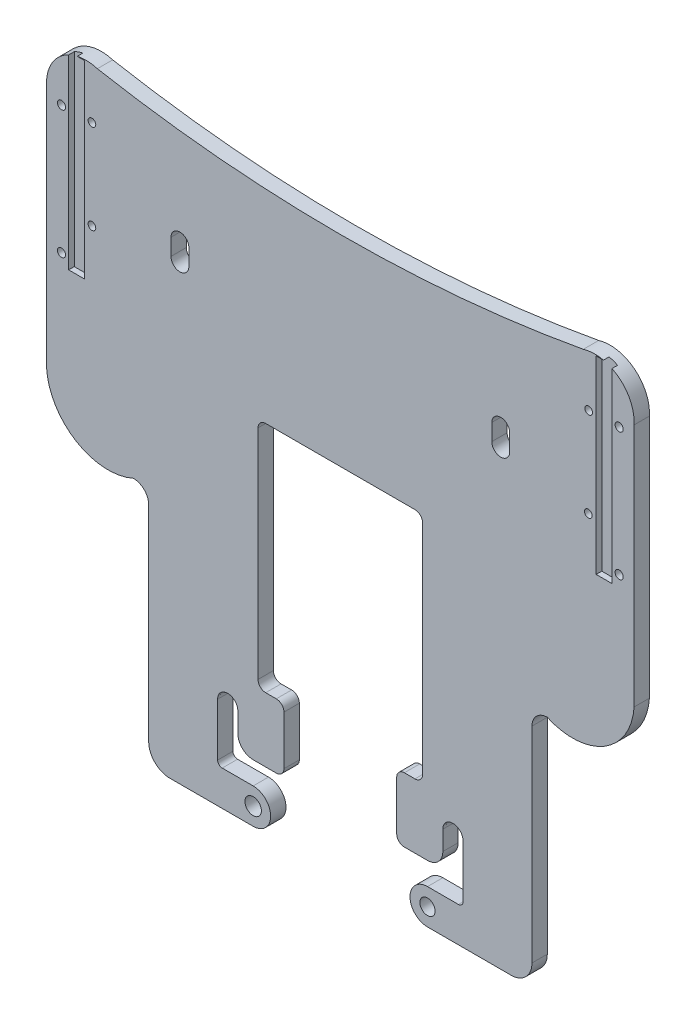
from build123d import *

# Parameters (mm, degrees)
MODEL_R             = 3.219165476
MODEL_R_2           = 2.983938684
BOSS_EXTRUDE1_DEPTH = 6
SKETCH3_R           = 1.6
CUT_EXTRUDE1_DEPTH  = 6
SKETCH4_R           = 1.5
CUT_EXTRUDE2_DEPTH  = 6
SKETCH5_W           = 6.2
SKETCH5_H           = 74
CUT_EXTRUDE3_DEPTH  = 2.2


with BuildPart() as part:
    # Model → Boss-Extrude1 (new body)
    with BuildSketch(Plane.XY):
        with BuildLine():
            Line((131.829549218, 228.984857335), (163.970280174, 228.984857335))
            ThreePointArc((163.970280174, 228.984857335), (170.811455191, 235.826032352), (163.970280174, 242.667207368))
            Line((163.970280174, 242.667207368), (151.86786242, 242.667207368))
            ThreePointArc((151.86786242, 242.667207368), (150.595070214, 243.194415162), (150.06786242, 244.467207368))
            Line((150.06786242, 244.467207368), (150.06786242, 265.098361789))
            add(Edge.make_bspline(
                [(150.06786242, 265.098361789), (150.06786242, 267.281416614), (151.837594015, 269.051488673), (154.020819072, 269.051488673)],
                knots=[11, 11, 11, 11, 12, 12, 12, 12], degree=3))
            add(Edge.make_bspline(
                [(154.020819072, 269.051488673), (156.202113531, 269.051488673), (157.970280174, 267.282981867), (157.970280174, 265.101857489)],
                knots=[12, 12, 12, 12, 13, 13, 13, 13], degree=3))
            Line((157.970280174, 265.101857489), (157.970280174, 257.525045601))
            ThreePointArc((157.970280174, 257.525045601), (159.727639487, 253.282404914), (163.970280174, 251.525045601))
            Line((163.970280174, 251.525045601), (173.011787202, 251.525045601))
            ThreePointArc((173.011787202, 251.525045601), (175.133107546, 252.403725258), (176.011787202, 254.525045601))
            Line((176.011787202, 254.525045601), (176.011787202, 273.688447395))
            ThreePointArc((176.011787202, 273.688447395), (175.133107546, 275.809767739), (173.011787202, 276.688447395))
            Line((173.011787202, 276.688447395), (168.873871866, 276.688447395))
            ThreePointArc((168.873871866, 276.688447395), (166.752551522, 277.567127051), (165.873871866, 279.688447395))
            Line((165.873871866, 279.688447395), (165.873871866, 364.875635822))
            ThreePointArc((165.873871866, 364.875635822), (166.752551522, 366.996956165), (168.873871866, 367.875635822))
            Line((168.873871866, 367.875635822), (227.236956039, 367.875635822))
            ThreePointArc((227.236956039, 367.875635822), (229.358276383, 366.996956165), (230.236956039, 364.875635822))
            Line((230.236956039, 364.875635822), (230.236956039, 279.688447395))
            ThreePointArc((230.236956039, 279.688447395), (229.358276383, 277.567127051), (227.236956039, 276.688447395))
            Line((227.236956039, 276.688447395), (223.099040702, 276.688447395))
            ThreePointArc((223.099040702, 276.688447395), (220.977720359, 275.809767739), (220.099040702, 273.688447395))
            Line((220.099040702, 273.688447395), (220.099040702, 254.525045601))
            ThreePointArc((220.099040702, 254.525045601), (220.977720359, 252.403725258), (223.099040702, 251.525045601))
            Line((223.099040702, 251.525045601), (232.140547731, 251.525045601))
            ThreePointArc((232.140547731, 251.525045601), (236.383188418, 253.282404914), (238.140547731, 257.525045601))
            Line((238.140547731, 257.525045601), (238.140547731, 265.101857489))
            add(Edge.make_bspline(
                [(242.090008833, 269.051488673), (239.908714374, 269.051488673), (238.140547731, 267.282981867), (238.140547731, 265.101857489)],
                knots=[12, 12, 12, 12, 13, 13, 13, 13], degree=3))
            add(Edge.make_bspline(
                [(246.042965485, 265.098361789), (246.042965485, 267.281416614), (244.27323389, 269.051488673), (242.090008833, 269.051488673)],
                knots=[11, 11, 11, 11, 12, 12, 12, 12], degree=3))
            Line((246.042965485, 265.098361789), (246.042965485, 244.467207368))
            ThreePointArc((246.042965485, 244.467207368), (245.515757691, 243.194415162), (244.242965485, 242.667207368))
            Line((244.242965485, 242.667207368), (232.140547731, 242.667207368))
            ThreePointArc((232.140547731, 242.667207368), (225.299372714, 235.826032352), (232.140547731, 228.984857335))
            Line((232.140547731, 228.984857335), (264.281278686, 228.984857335))
            ThreePointArc((264.281278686, 228.984857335), (270.408526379, 231.219869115), (272.99041559, 237.209217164))
            Line((272.99041559, 237.209217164), (272.99041559, 317.427116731))
            ThreePointArc((272.99041559, 317.427116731), (274.747774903, 321.669757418), (278.99041559, 323.427116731))
            ThreePointArc((278.99041559, 323.427116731), (301.312436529, 324.770851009), (312.92689819, 343.880600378))
            Line((312.92689819, 343.880600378), (312.92689819, 439.396976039))
            ThreePointArc((312.92689819, 439.396976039), (307.090115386, 452.419254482), (293.070721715, 455.08465697))
            ThreePointArc((293.070721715, 455.08465697), (198.055413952, 446.456237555), (103.04010619, 455.08465697))
            ThreePointArc((103.04010619, 455.08465697), (89.020712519, 452.419254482), (83.183929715, 439.396976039))
            Line((83.183929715, 439.396976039), (83.183929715, 343.880600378))
            ThreePointArc((83.183929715, 343.880600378), (94.798391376, 324.770851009), (117.120412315, 323.427116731))
            ThreePointArc((117.120412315, 323.427116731), (121.363053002, 321.669757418), (123.120412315, 317.427116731))
            Line((123.120412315, 317.427116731), (123.120412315, 237.209217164))
            ThreePointArc((123.120412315, 237.209217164), (125.702301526, 231.219869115), (131.829549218, 228.984857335))
        make_face()
        with Locations((163.970280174, 235.826032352)):
            Circle(MODEL_R, mode=Mode.SUBTRACT)
        with Locations((232.140547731, 235.826032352)):
            Circle(MODEL_R_2, mode=Mode.SUBTRACT)
        with BuildLine():
            Line((138.829549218, 412.416619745), (138.829549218, 405.929400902))
            ThreePointArc((138.829549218, 405.929400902), (135.329549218, 402.429400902), (131.829549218, 405.929400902))
            Line((131.829549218, 405.929400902), (131.829549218, 412.416619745))
            ThreePointArc((131.829549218, 412.416619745), (135.329549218, 415.916619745), (138.829549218, 412.416619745))
        make_face(mode=Mode.SUBTRACT)
        with BuildLine():
            Line((257.281278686, 412.416619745), (257.281278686, 405.929400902))
            ThreePointArc((257.281278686, 405.929400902), (260.781278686, 402.429400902), (264.281278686, 405.929400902))
            Line((264.281278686, 405.929400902), (264.281278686, 412.416619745))
            ThreePointArc((264.281278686, 412.416619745), (260.781278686, 415.916619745), (257.281278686, 412.416619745))
        make_face(mode=Mode.SUBTRACT)
    extrude(amount=BOSS_EXTRUDE1_DEPTH)

    # Sketch3 → Cut-Extrude1 (cut)
    with BuildSketch(Plane(origin=(0, 0, 0), x_dir=(-1, 0, 0), z_dir=(0, 0, -1))):
        with Locations((-89.020712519, 435.781657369)):
            Circle(SKETCH3_R)
        with Locations((-89.020712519, 385.781657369)):
            Circle(SKETCH3_R)
        with Locations(Location((-307.090115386, 385.781657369, 0), (0, 0, 180))):
            Circle(SKETCH3_R)
        with Locations(Location((-307.090115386, 435.781657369, 0), (0, 0, 180))):
            Circle(SKETCH3_R)
    extrude(amount=-CUT_EXTRUDE1_DEPTH, mode=Mode.SUBTRACT)

    # Sketch4 → Cut-Extrude2 (cut)
    with BuildSketch(Plane.XY.offset(6)):
        with Locations((295.027706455, 400.437850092)):
            Circle(SKETCH4_R)
        with Locations((295.151691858, 435.437630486)):
            Circle(SKETCH4_R)
        with Locations((100.920712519, 435.781657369)):
            Circle(SKETCH4_R)
        with Locations((100.920712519, 400.781657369)):
            Circle(SKETCH4_R)
    extrude(amount=-CUT_EXTRUDE2_DEPTH, mode=Mode.SUBTRACT)

    # Sketch5 → Cut-Extrude3 (cut)
    with BuildSketch(Plane.XY.offset(6)):
        with Locations((94.920712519, 418.358448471)):
            Rectangle(SKETCH5_W, SKETCH5_H)
        with Locations((301.190115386, 418.358448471)):
            Rectangle(SKETCH5_W, SKETCH5_H)
    extrude(amount=-CUT_EXTRUDE3_DEPTH, mode=Mode.SUBTRACT)


solid = part.part
